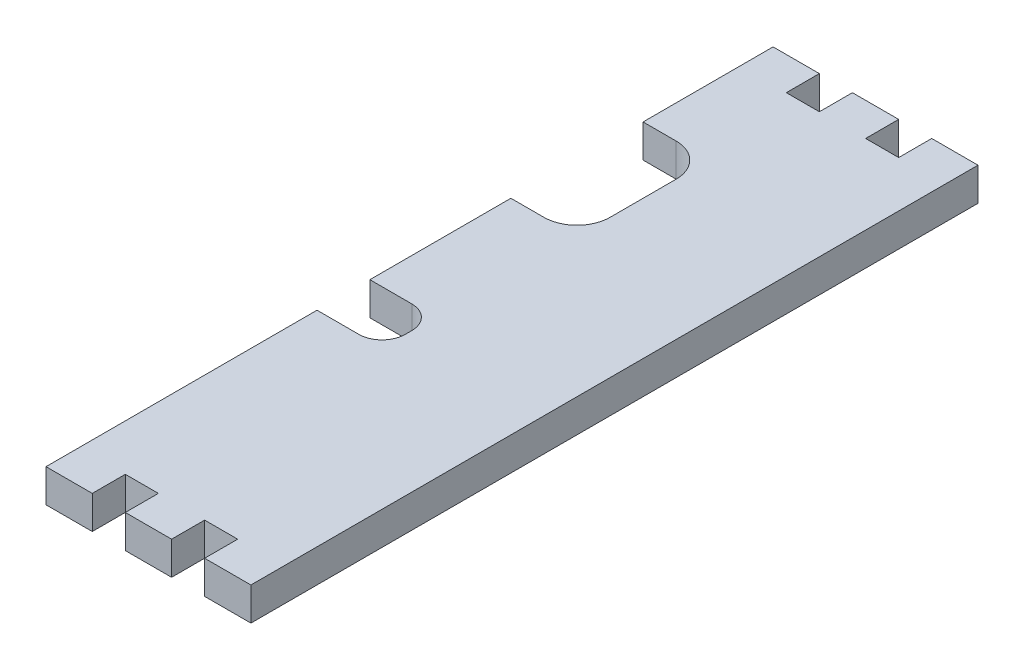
from build123d import *

# Parameters (mm, degrees)
ESQUISSE1_W             = 30
ESQUISSE1_H             = 5
BOSS_EXTRU_1_DEPTH      = 100
BOSS_EXTRU_2_DEPTH      = 5
BOSS_EXTRU_2_DEPTH_BACK = 105
ESQUISSE2_W             = 7
ESQUISSE2_H             = 5
ESQUISSE3_W             = 9.840679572
ESQUISSE3_H             = 8
ENL_V_MAT_EXTRU_1_DEPTH = 5
CONG_1_R                = 3.5
ENL_V_MAT_EXTRU_2_DEPTH = 10


with BuildPart() as part:
    # Esquisse1 → Boss.-Extru.1 (new body)
    with BuildSketch(Plane.XY):
        with Locations((15, 2.5)):
            Rectangle(ESQUISSE1_W, ESQUISSE1_H)
    extrude(amount=BOSS_EXTRU_1_DEPTH)

    # Esquisse2 → Boss.-Extru.2 (add, two sides: drawn at the far end of the back side and taken through both)
    with BuildSketch(Plane.XY.offset(100).offset(-BOSS_EXTRU_2_DEPTH_BACK)):
        with Locations((3.5, 2.5)):
            Rectangle(ESQUISSE2_W, ESQUISSE2_H)
        with Locations((15.5, 2.5)):
            Rectangle(ESQUISSE2_W, ESQUISSE2_H)
        with Locations((27.5, 2.5)):
            Rectangle(ESQUISSE2_W, ESQUISSE2_H)
    extrude(amount=BOSS_EXTRU_2_DEPTH + BOSS_EXTRU_2_DEPTH_BACK)

    # Esquisse3 → Enl_v. mat.-Extru.1 (cut)
    with BuildSketch(Plane(origin=(0, 5, 0), x_dir=(1, 0, 0), z_dir=(0, 1, 0))):
        with Locations((4.920339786, -60)):
            Rectangle(ESQUISSE3_W, ESQUISSE3_H)
    extrude(amount=-ENL_V_MAT_EXTRU_1_DEPTH, mode=Mode.SUBTRACT)

    # Cong_1
    cong_1_edges = [part.edges().sort_by_distance(p)[0] for p in [
        (9.840679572, 2.5, 56),
        (9.840679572, 2.5, 64),
    ]]
    fillet(cong_1_edges, radius=CONG_1_R)

    # Esquisse4 → Enl_v. mat.-Extru.2 (cut)
    with BuildSketch(Plane.XZ):
        with BuildLine():
            Line((-2, 14.668592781), (5, 14.668592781))
            ThreePointArc((5, 14.668592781), (8.535533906, 16.133058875), (10, 19.668592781))
            Line((10, 19.668592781), (10, 29.668592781))
            ThreePointArc((10, 29.668592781), (8.535533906, 33.204126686), (5, 34.668592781))
            Line((5, 34.668592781), (-2, 34.668592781))
            Line((-2, 34.668592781), (-2, 14.668592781))
        make_face()
    extrude(amount=-ENL_V_MAT_EXTRU_2_DEPTH, mode=Mode.SUBTRACT)


solid = part.part
